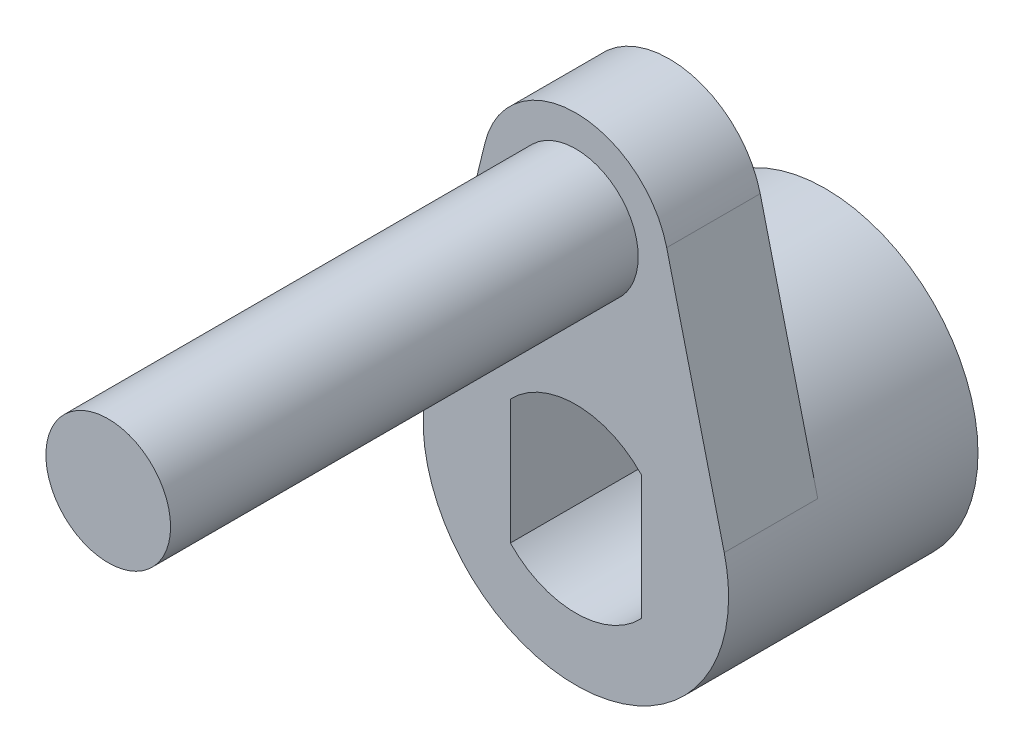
ISO-10303-21;
HEADER;
FILE_DESCRIPTION(('STEP AP214'),'2;1');
FILE_NAME('part.step','',(''),(''),'','','');
FILE_SCHEMA(('AUTOMOTIVE_DESIGN { 1 0 10303 214 1 1 1 1 }'));
ENDSEC;
DATA;
#1=APPLICATION_CONTEXT('core data for automotive mechanical design processes');
#2=APPLICATION_PROTOCOL_DEFINITION('international standard','automotive_design',2000,#1);
#3=PRODUCT_CONTEXT('',#1,'mechanical');
#4=PRODUCT('Part','Part','',(#3));
#5=PRODUCT_RELATED_PRODUCT_CATEGORY('part','',(#4));
#6=PRODUCT_DEFINITION_FORMATION('','',#4);
#7=PRODUCT_DEFINITION_CONTEXT('part definition',#1,'design');
#8=PRODUCT_DEFINITION('design','',#6,#7);
#9=PRODUCT_DEFINITION_SHAPE('','',#8);
#10=(LENGTH_UNIT() NAMED_UNIT(*) SI_UNIT(.MILLI.,.METRE.));
#11=(NAMED_UNIT(*) PLANE_ANGLE_UNIT() SI_UNIT($,.RADIAN.));
#12=(NAMED_UNIT(*) SI_UNIT($,.STERADIAN.) SOLID_ANGLE_UNIT());
#13=UNCERTAINTY_MEASURE_WITH_UNIT(LENGTH_MEASURE(1.E-05),#10,'distance_accuracy_value','');
#14=(GEOMETRIC_REPRESENTATION_CONTEXT(3) GLOBAL_UNCERTAINTY_ASSIGNED_CONTEXT((#13)) GLOBAL_UNIT_ASSIGNED_CONTEXT((#10,
#11,#12)) REPRESENTATION_CONTEXT('',''));
#15=CARTESIAN_POINT('',(0.,0.,0.));
#16=DIRECTION('',(0.,0.,1.));
#17=DIRECTION('',(1.,0.,0.));
#18=AXIS2_PLACEMENT_3D('',#15,#16,#17);
#19=CARTESIAN_POINT('',(-25.8,0.,-8.));
#20=DIRECTION('',(0.,0.,1.));
#21=DIRECTION('',(1.,0.,0.));
#22=AXIS2_PLACEMENT_3D('',#19,#20,#21);
#23=CYLINDRICAL_SURFACE('',#22,4.90000000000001);
#24=DIRECTION('',(0.,0.,1.));
#25=VECTOR('',#24,1.);
#26=CARTESIAN_POINT('',(-21.0402010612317,1.16375000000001,-3.));
#27=LINE('',#26,#25);
#28=CARTESIAN_POINT('',(-21.0402010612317,1.16375000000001,-3.));
#29=VERTEX_POINT('',#28);
#30=CARTESIAN_POINT('',(-21.0402010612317,1.16375000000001,0.));
#31=VERTEX_POINT('',#30);
#32=EDGE_CURVE('E134',#29,#31,#27,.T.);
#33=ORIENTED_EDGE('',*,*,#32,.T.);
#34=CARTESIAN_POINT('',(-25.8,0.,0.));
#35=DIRECTION('',(0.,0.,1.));
#36=DIRECTION('',(1.,0.,0.));
#37=AXIS2_PLACEMENT_3D('',#34,#35,#36);
#38=CIRCLE('',#37,4.90000000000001);
#39=CARTESIAN_POINT('',(-30.5597989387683,1.16375000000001,0.));
#40=VERTEX_POINT('',#39);
#41=EDGE_CURVE('E36',#40,#31,#38,.T.);
#42=ORIENTED_EDGE('',*,*,#41,.F.);
#43=DIRECTION('',(0.,0.,1.));
#44=VECTOR('',#43,1.);
#45=CARTESIAN_POINT('',(-30.5597989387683,1.16375000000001,-3.));
#46=LINE('',#45,#44);
#47=CARTESIAN_POINT('',(-30.5597989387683,1.16375000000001,-3.));
#48=VERTEX_POINT('',#47);
#49=EDGE_CURVE('E106',#48,#40,#46,.T.);
#50=ORIENTED_EDGE('',*,*,#49,.F.);
#51=CARTESIAN_POINT('',(-25.8,0.,-3.));
#52=DIRECTION('',(0.,0.,1.));
#53=DIRECTION('',(1.,0.,0.));
#54=AXIS2_PLACEMENT_3D('',#51,#52,#53);
#55=CIRCLE('',#54,4.90000000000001);
#56=EDGE_CURVE('E116',#48,#29,#55,.F.);
#57=ORIENTED_EDGE('',*,*,#56,.T.);
#58=EDGE_LOOP('',(#33,#42,#50,#57));
#59=FACE_BOUND('',#58,.T.);
#60=CARTESIAN_POINT('',(-25.8,0.,-8.));
#61=DIRECTION('',(0.,0.,1.));
#62=DIRECTION('',(1.,0.,0.));
#63=AXIS2_PLACEMENT_3D('',#60,#61,#62);
#64=CIRCLE('',#63,4.90000000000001);
#65=CARTESIAN_POINT('',(-20.9,0.,-8.));
#66=VERTEX_POINT('',#65);
#67=EDGE_CURVE('E11',#66,#66,#64,.T.);
#68=ORIENTED_EDGE('',*,*,#67,.T.);
#69=EDGE_LOOP('',(#68));
#70=FACE_BOUND('',#69,.T.);
#71=ADVANCED_FACE('F33',(#59,#70),#23,.T.);
#72=CARTESIAN_POINT('',(-25.8,0.,-8.));
#73=DIRECTION('',(0.,0.,1.));
#74=DIRECTION('',(1.,0.,0.));
#75=AXIS2_PLACEMENT_3D('',#72,#73,#74);
#76=PLANE('',#75);
#77=DIRECTION('',(0.,-1.,0.));
#78=VECTOR('',#77,1.);
#79=CARTESIAN_POINT('',(-27.9,2.00000000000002,-8.));
#80=LINE('',#79,#78);
#81=CARTESIAN_POINT('',(-27.9,2.00000000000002,-8.));
#82=VERTEX_POINT('',#81);
#83=CARTESIAN_POINT('',(-27.9,-2.00000000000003,-8.));
#84=VERTEX_POINT('',#83);
#85=EDGE_CURVE('E148',#82,#84,#80,.T.);
#86=ORIENTED_EDGE('',*,*,#85,.T.);
#87=CARTESIAN_POINT('',(-25.8,0.,-8.));
#88=DIRECTION('',(0.,0.,1.));
#89=DIRECTION('',(1.,0.,0.));
#90=AXIS2_PLACEMENT_3D('',#87,#88,#89);
#91=CIRCLE('',#90,2.90000000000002);
#92=CARTESIAN_POINT('',(-23.7,-2.00000000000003,-8.));
#93=VERTEX_POINT('',#92);
#94=EDGE_CURVE('E140',#84,#93,#91,.T.);
#95=ORIENTED_EDGE('',*,*,#94,.T.);
#96=DIRECTION('',(0.,1.,0.));
#97=VECTOR('',#96,1.);
#98=CARTESIAN_POINT('',(-23.7,-2.00000000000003,-8.));
#99=LINE('',#98,#97);
#100=CARTESIAN_POINT('',(-23.7,2.00000000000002,-8.));
#101=VERTEX_POINT('',#100);
#102=EDGE_CURVE('E143',#93,#101,#99,.T.);
#103=ORIENTED_EDGE('',*,*,#102,.T.);
#104=CARTESIAN_POINT('',(-25.8,0.,-8.));
#105=DIRECTION('',(0.,0.,1.));
#106=DIRECTION('',(1.,0.,0.));
#107=AXIS2_PLACEMENT_3D('',#104,#105,#106);
#108=CIRCLE('',#107,2.90000000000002);
#109=EDGE_CURVE('E55',#101,#82,#108,.T.);
#110=ORIENTED_EDGE('',*,*,#109,.T.);
#111=EDGE_LOOP('',(#86,#95,#103,#110));
#112=FACE_BOUND('',#111,.T.);
#113=ORIENTED_EDGE('',*,*,#67,.F.);
#114=EDGE_LOOP('',(#113));
#115=FACE_BOUND('',#114,.T.);
#116=ADVANCED_FACE('F183',(#112,#115),#76,.F.);
#117=CARTESIAN_POINT('',(-25.8,0.,0.));
#118=DIRECTION('',(0.,0.,1.));
#119=DIRECTION('',(1.,0.,0.));
#120=AXIS2_PLACEMENT_3D('',#117,#118,#119);
#121=PLANE('',#120);
#122=CARTESIAN_POINT('',(-25.8,8.,0.));
#123=DIRECTION('',(0.,0.,1.));
#124=DIRECTION('',(1.,0.,0.));
#125=AXIS2_PLACEMENT_3D('',#122,#123,#124);
#126=CIRCLE('',#125,2.);
#127=CARTESIAN_POINT('',(-23.8,8.,0.));
#128=VERTEX_POINT('',#127);
#129=EDGE_CURVE('E125',#128,#128,#126,.T.);
#130=ORIENTED_EDGE('',*,*,#129,.F.);
#131=EDGE_LOOP('',(#130));
#132=FACE_BOUND('',#131,.T.);
#133=CARTESIAN_POINT('',(-25.8,0.,0.));
#134=DIRECTION('',(0.,0.,1.));
#135=DIRECTION('',(1.,0.,0.));
#136=AXIS2_PLACEMENT_3D('',#133,#134,#135);
#137=CIRCLE('',#136,2.90000000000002);
#138=CARTESIAN_POINT('',(-27.9,-2.00000000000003,0.));
#139=VERTEX_POINT('',#138);
#140=CARTESIAN_POINT('',(-23.7,-2.00000000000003,0.));
#141=VERTEX_POINT('',#140);
#142=EDGE_CURVE('E139',#139,#141,#137,.T.);
#143=ORIENTED_EDGE('',*,*,#142,.F.);
#144=DIRECTION('',(0.,-1.,0.));
#145=VECTOR('',#144,1.);
#146=CARTESIAN_POINT('',(-27.9,2.00000000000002,0.));
#147=LINE('',#146,#145);
#148=CARTESIAN_POINT('',(-27.9,2.00000000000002,0.));
#149=VERTEX_POINT('',#148);
#150=EDGE_CURVE('E144',#149,#139,#147,.T.);
#151=ORIENTED_EDGE('',*,*,#150,.F.);
#152=CARTESIAN_POINT('',(-25.8,0.,0.));
#153=DIRECTION('',(0.,0.,1.));
#154=DIRECTION('',(1.,0.,0.));
#155=AXIS2_PLACEMENT_3D('',#152,#153,#154);
#156=CIRCLE('',#155,2.90000000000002);
#157=CARTESIAN_POINT('',(-23.7,2.00000000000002,0.));
#158=VERTEX_POINT('',#157);
#159=EDGE_CURVE('E157',#158,#149,#156,.T.);
#160=ORIENTED_EDGE('',*,*,#159,.F.);
#161=DIRECTION('',(0.,1.,0.));
#162=VECTOR('',#161,1.);
#163=CARTESIAN_POINT('',(-23.7,-2.00000000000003,0.));
#164=LINE('',#163,#162);
#165=EDGE_CURVE('E154',#141,#158,#164,.T.);
#166=ORIENTED_EDGE('',*,*,#165,.F.);
#167=EDGE_LOOP('',(#143,#151,#160,#166));
#168=FACE_BOUND('',#167,.T.);
#169=ORIENTED_EDGE('',*,*,#41,.T.);
#170=DIRECTION('',(-0.237500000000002,0.971387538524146,0.));
#171=VECTOR('',#170,1.);
#172=CARTESIAN_POINT('',(-21.0402010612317,1.16375000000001,0.));
#173=LINE('',#172,#171);
#174=CARTESIAN_POINT('',(-22.8858373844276,8.7125,0.));
#175=VERTEX_POINT('',#174);
#176=EDGE_CURVE('E120',#31,#175,#173,.T.);
#177=ORIENTED_EDGE('',*,*,#176,.T.);
#178=CARTESIAN_POINT('',(-25.8,8.,0.));
#179=DIRECTION('',(0.,0.,1.));
#180=DIRECTION('',(1.,0.,0.));
#181=AXIS2_PLACEMENT_3D('',#178,#179,#180);
#182=CIRCLE('',#181,3.);
#183=CARTESIAN_POINT('',(-28.7141626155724,8.7125,0.));
#184=VERTEX_POINT('',#183);
#185=EDGE_CURVE('E129',#175,#184,#182,.T.);
#186=ORIENTED_EDGE('',*,*,#185,.T.);
#187=DIRECTION('',(-0.237500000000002,-0.971387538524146,0.));
#188=VECTOR('',#187,1.);
#189=CARTESIAN_POINT('',(-30.5597989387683,1.16375000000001,0.));
#190=LINE('',#189,#188);
#191=EDGE_CURVE('E47',#184,#40,#190,.T.);
#192=ORIENTED_EDGE('',*,*,#191,.T.);
#193=EDGE_LOOP('',(#169,#177,#186,#192));
#194=FACE_BOUND('',#193,.T.);
#195=ADVANCED_FACE('F179',(#132,#168,#194),#121,.T.);
#196=CARTESIAN_POINT('',(-25.8,0.,-8.));
#197=DIRECTION('',(0.,0.,1.));
#198=DIRECTION('',(1.,0.,0.));
#199=AXIS2_PLACEMENT_3D('',#196,#197,#198);
#200=CYLINDRICAL_SURFACE('',#199,2.90000000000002);
#201=ORIENTED_EDGE('',*,*,#142,.T.);
#202=DIRECTION('',(0.,0.,1.));
#203=VECTOR('',#202,1.);
#204=CARTESIAN_POINT('',(-23.7,-2.00000000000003,-8.));
#205=LINE('',#204,#203);
#206=EDGE_CURVE('E151',#93,#141,#205,.T.);
#207=ORIENTED_EDGE('',*,*,#206,.F.);
#208=ORIENTED_EDGE('',*,*,#94,.F.);
#209=DIRECTION('',(0.,0.,1.));
#210=VECTOR('',#209,1.);
#211=CARTESIAN_POINT('',(-27.9,-2.00000000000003,-8.));
#212=LINE('',#211,#210);
#213=EDGE_CURVE('E162',#84,#139,#212,.T.);
#214=ORIENTED_EDGE('',*,*,#213,.T.);
#215=EDGE_LOOP('',(#201,#207,#208,#214));
#216=FACE_BOUND('',#215,.T.);
#217=ADVANCED_FACE('F176',(#216),#200,.F.);
#218=CARTESIAN_POINT('',(-27.9,2.00000000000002,-8.));
#219=DIRECTION('',(-1.,0.,0.));
#220=DIRECTION('',(0.,0.,1.));
#221=AXIS2_PLACEMENT_3D('',#218,#219,#220);
#222=PLANE('',#221);
#223=ORIENTED_EDGE('',*,*,#150,.T.);
#224=ORIENTED_EDGE('',*,*,#213,.F.);
#225=ORIENTED_EDGE('',*,*,#85,.F.);
#226=DIRECTION('',(0.,0.,1.));
#227=VECTOR('',#226,1.);
#228=CARTESIAN_POINT('',(-27.9,2.00000000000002,-8.));
#229=LINE('',#228,#227);
#230=EDGE_CURVE('E164',#82,#149,#229,.T.);
#231=ORIENTED_EDGE('',*,*,#230,.T.);
#232=EDGE_LOOP('',(#223,#224,#225,#231));
#233=FACE_BOUND('',#232,.T.);
#234=ADVANCED_FACE('F186',(#233),#222,.F.);
#235=CARTESIAN_POINT('',(-25.8,0.,-8.));
#236=DIRECTION('',(0.,0.,1.));
#237=DIRECTION('',(1.,0.,0.));
#238=AXIS2_PLACEMENT_3D('',#235,#236,#237);
#239=CYLINDRICAL_SURFACE('',#238,2.90000000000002);
#240=ORIENTED_EDGE('',*,*,#159,.T.);
#241=ORIENTED_EDGE('',*,*,#230,.F.);
#242=ORIENTED_EDGE('',*,*,#109,.F.);
#243=DIRECTION('',(0.,0.,1.));
#244=VECTOR('',#243,1.);
#245=CARTESIAN_POINT('',(-23.7,2.00000000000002,-8.));
#246=LINE('',#245,#244);
#247=EDGE_CURVE('E166',#101,#158,#246,.T.);
#248=ORIENTED_EDGE('',*,*,#247,.T.);
#249=EDGE_LOOP('',(#240,#241,#242,#248));
#250=FACE_BOUND('',#249,.T.);
#251=ADVANCED_FACE('F180',(#250),#239,.F.);
#252=CARTESIAN_POINT('',(-23.7,-2.00000000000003,-8.));
#253=DIRECTION('',(1.,0.,0.));
#254=DIRECTION('',(0.,0.,-1.));
#255=AXIS2_PLACEMENT_3D('',#252,#253,#254);
#256=PLANE('',#255);
#257=ORIENTED_EDGE('',*,*,#165,.T.);
#258=ORIENTED_EDGE('',*,*,#247,.F.);
#259=ORIENTED_EDGE('',*,*,#102,.F.);
#260=ORIENTED_EDGE('',*,*,#206,.T.);
#261=EDGE_LOOP('',(#257,#258,#259,#260));
#262=FACE_BOUND('',#261,.T.);
#263=ADVANCED_FACE('F170',(#262),#256,.F.);
#264=CARTESIAN_POINT('',(-25.8,8.,-3.));
#265=DIRECTION('',(0.,0.,1.));
#266=DIRECTION('',(1.,0.,0.));
#267=AXIS2_PLACEMENT_3D('',#264,#265,#266);
#268=CYLINDRICAL_SURFACE('',#267,3.);
#269=ORIENTED_EDGE('',*,*,#185,.F.);
#270=DIRECTION('',(0.,0.,1.));
#271=VECTOR('',#270,1.);
#272=CARTESIAN_POINT('',(-22.8858373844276,8.7125,-3.));
#273=LINE('',#272,#271);
#274=CARTESIAN_POINT('',(-22.8858373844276,8.7125,-3.));
#275=VERTEX_POINT('',#274);
#276=EDGE_CURVE('E119',#275,#175,#273,.T.);
#277=ORIENTED_EDGE('',*,*,#276,.F.);
#278=CARTESIAN_POINT('',(-25.8,8.,-3.));
#279=DIRECTION('',(0.,0.,1.));
#280=DIRECTION('',(1.,0.,0.));
#281=AXIS2_PLACEMENT_3D('',#278,#279,#280);
#282=CIRCLE('',#281,3.);
#283=CARTESIAN_POINT('',(-28.7141626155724,8.7125,-3.));
#284=VERTEX_POINT('',#283);
#285=EDGE_CURVE('E113',#275,#284,#282,.T.);
#286=ORIENTED_EDGE('',*,*,#285,.T.);
#287=DIRECTION('',(0.,0.,1.));
#288=VECTOR('',#287,1.);
#289=CARTESIAN_POINT('',(-28.7141626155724,8.7125,-3.));
#290=LINE('',#289,#288);
#291=EDGE_CURVE('E98',#284,#184,#290,.T.);
#292=ORIENTED_EDGE('',*,*,#291,.T.);
#293=EDGE_LOOP('',(#269,#277,#286,#292));
#294=FACE_BOUND('',#293,.T.);
#295=ADVANCED_FACE('F118',(#294),#268,.T.);
#296=CARTESIAN_POINT('',(-21.0402010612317,1.16375000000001,-3.));
#297=DIRECTION('',(0.971387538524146,0.237500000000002,0.));
#298=DIRECTION('',(-0.237500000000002,0.971387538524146,0.));
#299=AXIS2_PLACEMENT_3D('',#296,#297,#298);
#300=PLANE('',#299);
#301=ORIENTED_EDGE('',*,*,#176,.F.);
#302=ORIENTED_EDGE('',*,*,#32,.F.);
#303=DIRECTION('',(-0.237500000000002,0.971387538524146,0.));
#304=VECTOR('',#303,1.);
#305=CARTESIAN_POINT('',(-21.0402010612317,1.16375000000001,-3.));
#306=LINE('',#305,#304);
#307=EDGE_CURVE('E107',#29,#275,#306,.T.);
#308=ORIENTED_EDGE('',*,*,#307,.T.);
#309=ORIENTED_EDGE('',*,*,#276,.T.);
#310=EDGE_LOOP('',(#301,#302,#308,#309));
#311=FACE_BOUND('',#310,.T.);
#312=ADVANCED_FACE('F206',(#311),#300,.T.);
#313=CARTESIAN_POINT('',(-30.5597989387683,1.16375000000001,-3.));
#314=DIRECTION('',(-0.971387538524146,0.237500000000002,0.));
#315=DIRECTION('',(-0.237500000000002,-0.971387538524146,0.));
#316=AXIS2_PLACEMENT_3D('',#313,#314,#315);
#317=PLANE('',#316);
#318=ORIENTED_EDGE('',*,*,#191,.F.);
#319=ORIENTED_EDGE('',*,*,#291,.F.);
#320=DIRECTION('',(-0.237500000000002,-0.971387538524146,0.));
#321=VECTOR('',#320,1.);
#322=CARTESIAN_POINT('',(-30.5597989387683,1.16375000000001,-3.));
#323=LINE('',#322,#321);
#324=EDGE_CURVE('E101',#284,#48,#323,.T.);
#325=ORIENTED_EDGE('',*,*,#324,.T.);
#326=ORIENTED_EDGE('',*,*,#49,.T.);
#327=EDGE_LOOP('',(#318,#319,#325,#326));
#328=FACE_BOUND('',#327,.T.);
#329=ADVANCED_FACE('F100',(#328),#317,.T.);
#330=CARTESIAN_POINT('',(-25.8,8.,-3.));
#331=DIRECTION('',(0.,0.,1.));
#332=DIRECTION('',(1.,0.,0.));
#333=AXIS2_PLACEMENT_3D('',#330,#331,#332);
#334=PLANE('',#333);
#335=ORIENTED_EDGE('',*,*,#56,.F.);
#336=ORIENTED_EDGE('',*,*,#324,.F.);
#337=ORIENTED_EDGE('',*,*,#285,.F.);
#338=ORIENTED_EDGE('',*,*,#307,.F.);
#339=EDGE_LOOP('',(#335,#336,#337,#338));
#340=FACE_BOUND('',#339,.T.);
#341=ADVANCED_FACE('F111',(#340),#334,.F.);
#342=CARTESIAN_POINT('',(-25.8,8.,15.));
#343=DIRECTION('',(0.,0.,-1.));
#344=DIRECTION('',(-1.,0.,0.));
#345=AXIS2_PLACEMENT_3D('',#342,#343,#344);
#346=CYLINDRICAL_SURFACE('',#345,2.);
#347=CARTESIAN_POINT('',(-25.8,8.,15.));
#348=DIRECTION('',(0.,0.,1.));
#349=DIRECTION('',(1.,0.,0.));
#350=AXIS2_PLACEMENT_3D('',#347,#348,#349);
#351=CIRCLE('',#350,2.);
#352=CARTESIAN_POINT('',(-23.8,8.,15.));
#353=VERTEX_POINT('',#352);
#354=EDGE_CURVE('E131',#353,#353,#351,.T.);
#355=ORIENTED_EDGE('',*,*,#354,.F.);
#356=EDGE_LOOP('',(#355));
#357=FACE_BOUND('',#356,.T.);
#358=ORIENTED_EDGE('',*,*,#129,.T.);
#359=EDGE_LOOP('',(#358));
#360=FACE_BOUND('',#359,.T.);
#361=ADVANCED_FACE('F217',(#357,#360),#346,.T.);
#362=CARTESIAN_POINT('',(-25.8,8.,15.));
#363=DIRECTION('',(0.,0.,1.));
#364=DIRECTION('',(1.,0.,0.));
#365=AXIS2_PLACEMENT_3D('',#362,#363,#364);
#366=PLANE('',#365);
#367=ORIENTED_EDGE('',*,*,#354,.T.);
#368=EDGE_LOOP('',(#367));
#369=FACE_BOUND('',#368,.T.);
#370=ADVANCED_FACE('F220',(#369),#366,.T.);
#371=CLOSED_SHELL('',(#71,#116,#195,#217,#234,#251,#263,#295,#312,#329,#341,#361,#370));
#372=MANIFOLD_SOLID_BREP('B2',#371);
#373=ADVANCED_BREP_SHAPE_REPRESENTATION('',(#18,#372),#14);
#374=SHAPE_DEFINITION_REPRESENTATION(#9,#373);
ENDSEC;
END-ISO-10303-21;
